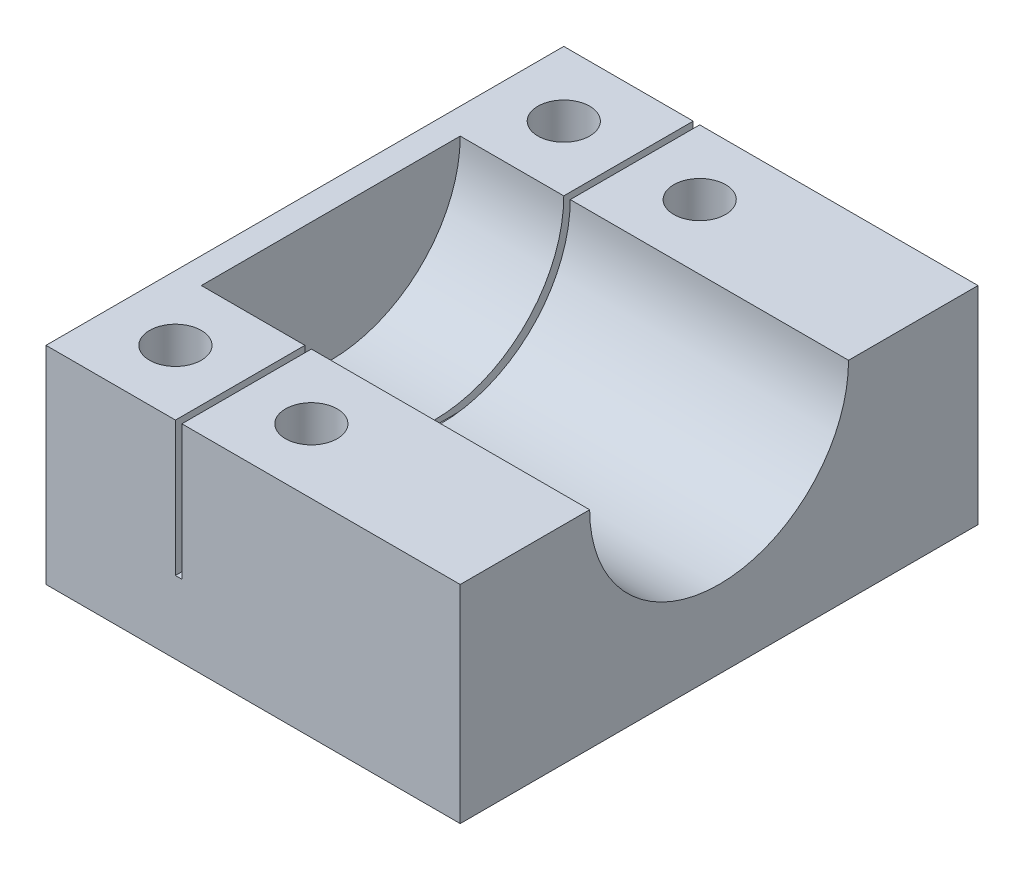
ISO-10303-21;
HEADER;
FILE_DESCRIPTION(('STEP AP214'),'2;1');
FILE_NAME('part.step','',(''),(''),'','','');
FILE_SCHEMA(('AUTOMOTIVE_DESIGN { 1 0 10303 214 1 1 1 1 }'));
ENDSEC;
DATA;
#1=APPLICATION_CONTEXT('core data for automotive mechanical design processes');
#2=APPLICATION_PROTOCOL_DEFINITION('international standard','automotive_design',2000,#1);
#3=PRODUCT_CONTEXT('',#1,'mechanical');
#4=PRODUCT('Part','Part','',(#3));
#5=PRODUCT_RELATED_PRODUCT_CATEGORY('part','',(#4));
#6=PRODUCT_DEFINITION_FORMATION('','',#4);
#7=PRODUCT_DEFINITION_CONTEXT('part definition',#1,'design');
#8=PRODUCT_DEFINITION('design','',#6,#7);
#9=PRODUCT_DEFINITION_SHAPE('','',#8);
#10=(LENGTH_UNIT() NAMED_UNIT(*) SI_UNIT(.MILLI.,.METRE.));
#11=(NAMED_UNIT(*) PLANE_ANGLE_UNIT() SI_UNIT($,.RADIAN.));
#12=(NAMED_UNIT(*) SI_UNIT($,.STERADIAN.) SOLID_ANGLE_UNIT());
#13=UNCERTAINTY_MEASURE_WITH_UNIT(LENGTH_MEASURE(1.E-05),#10,'distance_accuracy_value','');
#14=(GEOMETRIC_REPRESENTATION_CONTEXT(3) GLOBAL_UNCERTAINTY_ASSIGNED_CONTEXT((#13)) GLOBAL_UNIT_ASSIGNED_CONTEXT((#10,
#11,#12)) REPRESENTATION_CONTEXT('',''));
#15=CARTESIAN_POINT('',(0.,0.,0.));
#16=DIRECTION('',(0.,0.,1.));
#17=DIRECTION('',(1.,0.,0.));
#18=AXIS2_PLACEMENT_3D('',#15,#16,#17);
#19=CARTESIAN_POINT('',(0.,50.8,0.));
#20=DIRECTION('',(0.,-1.,0.));
#21=DIRECTION('',(0.,0.,-1.));
#22=AXIS2_PLACEMENT_3D('',#19,#20,#21);
#23=PLANE('',#22);
#24=CARTESIAN_POINT('',(49.2125,50.8,-15.875));
#25=DIRECTION('',(0.,-1.,0.));
#26=DIRECTION('',(0.,0.,-1.));
#27=AXIS2_PLACEMENT_3D('',#24,#25,#26);
#28=CIRCLE('',#27,6.35);
#29=CARTESIAN_POINT('',(49.2125,50.8,-22.225));
#30=VERTEX_POINT('',#29);
#31=EDGE_CURVE('E678',#30,#30,#28,.T.);
#32=ORIENTED_EDGE('',*,*,#31,.T.);
#33=EDGE_LOOP('',(#32));
#34=FACE_BOUND('',#33,.T.);
#35=DIRECTION('',(0.,0.,1.));
#36=VECTOR('',#35,1.);
#37=CARTESIAN_POINT('',(33.3375,50.8,0.));
#38=LINE('',#37,#36);
#39=CARTESIAN_POINT('',(33.3375,50.8,-31.75));
#40=VERTEX_POINT('',#39);
#41=CARTESIAN_POINT('',(33.3375,50.8,0.));
#42=VERTEX_POINT('',#41);
#43=EDGE_CURVE('E464',#40,#42,#38,.T.);
#44=ORIENTED_EDGE('',*,*,#43,.T.);
#45=DIRECTION('',(1.,0.,0.));
#46=VECTOR('',#45,1.);
#47=CARTESIAN_POINT('',(0.,50.8,0.));
#48=LINE('',#47,#46);
#49=CARTESIAN_POINT('',(101.6,50.8,0.));
#50=VERTEX_POINT('',#49);
#51=EDGE_CURVE('E511',#42,#50,#48,.T.);
#52=ORIENTED_EDGE('',*,*,#51,.T.);
#53=DIRECTION('',(0.,0.,-1.));
#54=VECTOR('',#53,1.);
#55=CARTESIAN_POINT('',(101.6,50.8,0.));
#56=LINE('',#55,#54);
#57=CARTESIAN_POINT('',(101.6,50.8,-31.75));
#58=VERTEX_POINT('',#57);
#59=EDGE_CURVE('E517',#50,#58,#56,.T.);
#60=ORIENTED_EDGE('',*,*,#59,.T.);
#61=DIRECTION('',(-1.,0.,0.));
#62=VECTOR('',#61,1.);
#63=CARTESIAN_POINT('',(101.600012,50.8,-31.75));
#64=LINE('',#63,#62);
#65=EDGE_CURVE('E549',#40,#58,#64,.F.);
#66=ORIENTED_EDGE('',*,*,#65,.F.);
#67=EDGE_LOOP('',(#44,#52,#60,#66));
#68=FACE_BOUND('',#67,.T.);
#69=ADVANCED_FACE('F38',(#34,#68),#23,.F.);
#70=CARTESIAN_POINT('',(49.2125,50.8,-111.125));
#71=DIRECTION('',(0.,-1.,0.));
#72=DIRECTION('',(0.,0.,-1.));
#73=AXIS2_PLACEMENT_3D('',#70,#71,#72);
#74=CIRCLE('',#73,6.35);
#75=CARTESIAN_POINT('',(49.2125,50.8,-117.475));
#76=VERTEX_POINT('',#75);
#77=EDGE_CURVE('E677',#76,#76,#74,.T.);
#78=ORIENTED_EDGE('',*,*,#77,.T.);
#79=EDGE_LOOP('',(#78));
#80=FACE_BOUND('',#79,.T.);
#81=CARTESIAN_POINT('',(33.3375,50.8,-127.));
#82=VERTEX_POINT('',#81);
#83=CARTESIAN_POINT('',(33.3375,50.8,-95.25));
#84=VERTEX_POINT('',#83);
#85=EDGE_CURVE('E488',#82,#84,#38,.T.);
#86=ORIENTED_EDGE('',*,*,#85,.T.);
#87=DIRECTION('',(-1.,0.,0.));
#88=VECTOR('',#87,1.);
#89=CARTESIAN_POINT('',(101.600012,50.8,-95.25));
#90=LINE('',#89,#88);
#91=CARTESIAN_POINT('',(101.6,50.8,-95.25));
#92=VERTEX_POINT('',#91);
#93=EDGE_CURVE('E546',#92,#84,#90,.T.);
#94=ORIENTED_EDGE('',*,*,#93,.F.);
#95=CARTESIAN_POINT('',(101.6,50.8,-127.));
#96=VERTEX_POINT('',#95);
#97=EDGE_CURVE('E516',#92,#96,#56,.T.);
#98=ORIENTED_EDGE('',*,*,#97,.T.);
#99=DIRECTION('',(-1.,0.,0.));
#100=VECTOR('',#99,1.);
#101=CARTESIAN_POINT('',(0.,50.8,-127.));
#102=LINE('',#101,#100);
#103=EDGE_CURVE('E521',#96,#82,#102,.T.);
#104=ORIENTED_EDGE('',*,*,#103,.T.);
#105=EDGE_LOOP('',(#86,#94,#98,#104));
#106=FACE_BOUND('',#105,.T.);
#107=ADVANCED_FACE('F653',(#80,#106),#23,.F.);
#108=CARTESIAN_POINT('',(0.,50.8,0.));
#109=DIRECTION('',(0.,0.,-1.));
#110=DIRECTION('',(-1.,0.,0.));
#111=AXIS2_PLACEMENT_3D('',#108,#109,#110);
#112=PLANE('',#111);
#113=DIRECTION('',(0.,1.,0.));
#114=VECTOR('',#113,1.);
#115=CARTESIAN_POINT('',(33.3375,17.78,0.));
#116=LINE('',#115,#114);
#117=CARTESIAN_POINT('',(33.3375,17.78,0.));
#118=VERTEX_POINT('',#117);
#119=EDGE_CURVE('E493',#118,#42,#116,.T.);
#120=ORIENTED_EDGE('',*,*,#119,.F.);
#121=DIRECTION('',(1.,0.,0.));
#122=VECTOR('',#121,1.);
#123=CARTESIAN_POINT('',(0.,17.78,0.));
#124=LINE('',#123,#122);
#125=CARTESIAN_POINT('',(31.75,17.78,0.));
#126=VERTEX_POINT('',#125);
#127=EDGE_CURVE('E484',#126,#118,#124,.T.);
#128=ORIENTED_EDGE('',*,*,#127,.F.);
#129=DIRECTION('',(0.,1.,0.));
#130=VECTOR('',#129,1.);
#131=CARTESIAN_POINT('',(31.75,17.78,0.));
#132=LINE('',#131,#130);
#133=CARTESIAN_POINT('',(31.75,50.8,0.));
#134=VERTEX_POINT('',#133);
#135=EDGE_CURVE('E496',#126,#134,#132,.T.);
#136=ORIENTED_EDGE('',*,*,#135,.T.);
#137=CARTESIAN_POINT('',(0.,50.8,0.));
#138=VERTEX_POINT('',#137);
#139=EDGE_CURVE('E513',#138,#134,#48,.T.);
#140=ORIENTED_EDGE('',*,*,#139,.F.);
#141=DIRECTION('',(0.,-1.,0.));
#142=VECTOR('',#141,1.);
#143=CARTESIAN_POINT('',(0.,50.8,0.));
#144=LINE('',#143,#142);
#145=CARTESIAN_POINT('',(0.,0.,0.));
#146=VERTEX_POINT('',#145);
#147=EDGE_CURVE('E540',#138,#146,#144,.T.);
#148=ORIENTED_EDGE('',*,*,#147,.T.);
#149=DIRECTION('',(1.,0.,0.));
#150=VECTOR('',#149,1.);
#151=CARTESIAN_POINT('',(0.,0.,0.));
#152=LINE('',#151,#150);
#153=CARTESIAN_POINT('',(101.6,0.,0.));
#154=VERTEX_POINT('',#153);
#155=EDGE_CURVE('E527',#146,#154,#152,.T.);
#156=ORIENTED_EDGE('',*,*,#155,.T.);
#157=DIRECTION('',(0.,-1.,0.));
#158=VECTOR('',#157,1.);
#159=CARTESIAN_POINT('',(101.6,50.8,0.));
#160=LINE('',#159,#158);
#161=EDGE_CURVE('E537',#50,#154,#160,.T.);
#162=ORIENTED_EDGE('',*,*,#161,.F.);
#163=ORIENTED_EDGE('',*,*,#51,.F.);
#164=EDGE_LOOP('',(#120,#128,#136,#140,#148,#156,#162,#163));
#165=FACE_BOUND('',#164,.T.);
#166=ADVANCED_FACE('F626',(#165),#112,.F.);
#167=CARTESIAN_POINT('',(0.,50.8,-127.));
#168=DIRECTION('',(0.,0.,1.));
#169=DIRECTION('',(1.,0.,0.));
#170=AXIS2_PLACEMENT_3D('',#167,#168,#169);
#171=PLANE('',#170);
#172=DIRECTION('',(0.,1.,0.));
#173=VECTOR('',#172,1.);
#174=CARTESIAN_POINT('',(33.3375,17.78,-127.));
#175=LINE('',#174,#173);
#176=CARTESIAN_POINT('',(33.3375,17.78,-127.));
#177=VERTEX_POINT('',#176);
#178=EDGE_CURVE('E487',#177,#82,#175,.T.);
#179=ORIENTED_EDGE('',*,*,#178,.T.);
#180=ORIENTED_EDGE('',*,*,#103,.F.);
#181=DIRECTION('',(0.,-1.,0.));
#182=VECTOR('',#181,1.);
#183=CARTESIAN_POINT('',(101.6,50.8,-127.));
#184=LINE('',#183,#182);
#185=CARTESIAN_POINT('',(101.6,0.,-127.));
#186=VERTEX_POINT('',#185);
#187=EDGE_CURVE('E534',#96,#186,#184,.T.);
#188=ORIENTED_EDGE('',*,*,#187,.T.);
#189=DIRECTION('',(-1.,0.,0.));
#190=VECTOR('',#189,1.);
#191=CARTESIAN_POINT('',(0.,0.,-127.));
#192=LINE('',#191,#190);
#193=CARTESIAN_POINT('',(0.,0.,-127.));
#194=VERTEX_POINT('',#193);
#195=EDGE_CURVE('E512',#186,#194,#192,.T.);
#196=ORIENTED_EDGE('',*,*,#195,.T.);
#197=DIRECTION('',(0.,-1.,0.));
#198=VECTOR('',#197,1.);
#199=CARTESIAN_POINT('',(0.,50.8,-127.));
#200=LINE('',#199,#198);
#201=CARTESIAN_POINT('',(0.,50.8,-127.));
#202=VERTEX_POINT('',#201);
#203=EDGE_CURVE('E524',#202,#194,#200,.T.);
#204=ORIENTED_EDGE('',*,*,#203,.F.);
#205=CARTESIAN_POINT('',(31.75,50.8,-127.));
#206=VERTEX_POINT('',#205);
#207=EDGE_CURVE('E520',#206,#202,#102,.T.);
#208=ORIENTED_EDGE('',*,*,#207,.F.);
#209=DIRECTION('',(0.,1.,0.));
#210=VECTOR('',#209,1.);
#211=CARTESIAN_POINT('',(31.75,17.78,-127.));
#212=LINE('',#211,#210);
#213=CARTESIAN_POINT('',(31.75,17.78,-127.));
#214=VERTEX_POINT('',#213);
#215=EDGE_CURVE('E499',#214,#206,#212,.T.);
#216=ORIENTED_EDGE('',*,*,#215,.F.);
#217=DIRECTION('',(-1.,0.,0.));
#218=VECTOR('',#217,1.);
#219=CARTESIAN_POINT('',(0.,17.78,-127.));
#220=LINE('',#219,#218);
#221=EDGE_CURVE('E477',#177,#214,#220,.T.);
#222=ORIENTED_EDGE('',*,*,#221,.F.);
#223=EDGE_LOOP('',(#179,#180,#188,#196,#204,#208,#216,#222));
#224=FACE_BOUND('',#223,.T.);
#225=ADVANCED_FACE('F614',(#224),#171,.F.);
#226=CARTESIAN_POINT('',(101.600012,50.8,-63.5));
#227=DIRECTION('',(-1.,0.,0.));
#228=DIRECTION('',(0.,0.,1.));
#229=AXIS2_PLACEMENT_3D('',#226,#227,#228);
#230=CYLINDRICAL_SURFACE('',#229,31.75);
#231=ORIENTED_EDGE('',*,*,#93,.T.);
#232=CARTESIAN_POINT('',(33.3375,50.8,-63.5));
#233=DIRECTION('',(-1.,0.,0.));
#234=DIRECTION('',(0.,0.,1.));
#235=AXIS2_PLACEMENT_3D('',#232,#233,#234);
#236=CIRCLE('',#235,31.75);
#237=EDGE_CURVE('E11',#84,#40,#236,.T.);
#238=ORIENTED_EDGE('',*,*,#237,.T.);
#239=ORIENTED_EDGE('',*,*,#65,.T.);
#240=CARTESIAN_POINT('',(101.6,50.8,-63.5));
#241=DIRECTION('',(-1.,0.,0.));
#242=DIRECTION('',(0.,0.,1.));
#243=AXIS2_PLACEMENT_3D('',#240,#241,#242);
#244=CIRCLE('',#243,31.75);
#245=EDGE_CURVE('E505',#58,#92,#244,.F.);
#246=ORIENTED_EDGE('',*,*,#245,.T.);
#247=EDGE_LOOP('',(#231,#238,#239,#246));
#248=FACE_BOUND('',#247,.T.);
#249=ADVANCED_FACE('F650',(#248),#230,.F.);
#250=CARTESIAN_POINT('',(15.875,50.8,-15.875));
#251=DIRECTION('',(0.,-1.,0.));
#252=DIRECTION('',(0.,0.,-1.));
#253=AXIS2_PLACEMENT_3D('',#250,#251,#252);
#254=CIRCLE('',#253,6.35);
#255=CARTESIAN_POINT('',(15.875,50.8,-22.225));
#256=VERTEX_POINT('',#255);
#257=EDGE_CURVE('E673',#256,#256,#254,.T.);
#258=ORIENTED_EDGE('',*,*,#257,.T.);
#259=EDGE_LOOP('',(#258));
#260=FACE_BOUND('',#259,.T.);
#261=CARTESIAN_POINT('',(15.875,50.8,-111.125));
#262=DIRECTION('',(0.,-1.,0.));
#263=DIRECTION('',(0.,0.,-1.));
#264=AXIS2_PLACEMENT_3D('',#261,#262,#263);
#265=CIRCLE('',#264,6.35);
#266=CARTESIAN_POINT('',(15.875,50.8,-117.475));
#267=VERTEX_POINT('',#266);
#268=EDGE_CURVE('E304',#267,#267,#265,.T.);
#269=ORIENTED_EDGE('',*,*,#268,.T.);
#270=EDGE_LOOP('',(#269));
#271=FACE_BOUND('',#270,.T.);
#272=ORIENTED_EDGE('',*,*,#139,.T.);
#273=DIRECTION('',(0.,0.,1.));
#274=VECTOR('',#273,1.);
#275=CARTESIAN_POINT('',(31.75,50.8,0.));
#276=LINE('',#275,#274);
#277=CARTESIAN_POINT('',(31.75,50.8,-31.75));
#278=VERTEX_POINT('',#277);
#279=EDGE_CURVE('E491',#278,#134,#276,.T.);
#280=ORIENTED_EDGE('',*,*,#279,.F.);
#281=CARTESIAN_POINT('',(6.34999999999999,50.8,-31.75));
#282=VERTEX_POINT('',#281);
#283=EDGE_CURVE('E550',#282,#278,#64,.F.);
#284=ORIENTED_EDGE('',*,*,#283,.F.);
#285=DIRECTION('',(0.,0.,1.));
#286=VECTOR('',#285,1.);
#287=CARTESIAN_POINT('',(6.34999999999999,50.8,0.));
#288=LINE('',#287,#286);
#289=CARTESIAN_POINT('',(6.34999999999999,50.8,-95.25));
#290=VERTEX_POINT('',#289);
#291=EDGE_CURVE('E543',#290,#282,#288,.T.);
#292=ORIENTED_EDGE('',*,*,#291,.F.);
#293=CARTESIAN_POINT('',(31.75,50.8,-95.25));
#294=VERTEX_POINT('',#293);
#295=EDGE_CURVE('E545',#294,#290,#90,.T.);
#296=ORIENTED_EDGE('',*,*,#295,.F.);
#297=EDGE_CURVE('E478',#206,#294,#276,.T.);
#298=ORIENTED_EDGE('',*,*,#297,.F.);
#299=ORIENTED_EDGE('',*,*,#207,.T.);
#300=DIRECTION('',(0.,0.,1.));
#301=VECTOR('',#300,1.);
#302=CARTESIAN_POINT('',(0.,50.8,0.));
#303=LINE('',#302,#301);
#304=EDGE_CURVE('E508',#202,#138,#303,.T.);
#305=ORIENTED_EDGE('',*,*,#304,.T.);
#306=EDGE_LOOP('',(#272,#280,#284,#292,#296,#298,#299,#305));
#307=FACE_BOUND('',#306,.T.);
#308=ADVANCED_FACE('F630',(#260,#271,#307),#23,.F.);
#309=CARTESIAN_POINT('',(0.,50.8,0.));
#310=DIRECTION('',(1.,0.,0.));
#311=DIRECTION('',(0.,0.,-1.));
#312=AXIS2_PLACEMENT_3D('',#309,#310,#311);
#313=PLANE('',#312);
#314=DIRECTION('',(0.,0.,1.));
#315=VECTOR('',#314,1.);
#316=CARTESIAN_POINT('',(0.,0.,0.));
#317=LINE('',#316,#315);
#318=EDGE_CURVE('E507',#194,#146,#317,.T.);
#319=ORIENTED_EDGE('',*,*,#318,.T.);
#320=ORIENTED_EDGE('',*,*,#147,.F.);
#321=ORIENTED_EDGE('',*,*,#304,.F.);
#322=ORIENTED_EDGE('',*,*,#203,.T.);
#323=EDGE_LOOP('',(#319,#320,#321,#322));
#324=FACE_BOUND('',#323,.T.);
#325=ADVANCED_FACE('F40',(#324),#313,.F.);
#326=CARTESIAN_POINT('',(101.6,50.8,0.));
#327=DIRECTION('',(-1.,0.,0.));
#328=DIRECTION('',(0.,0.,1.));
#329=AXIS2_PLACEMENT_3D('',#326,#327,#328);
#330=PLANE('',#329);
#331=ORIENTED_EDGE('',*,*,#245,.F.);
#332=ORIENTED_EDGE('',*,*,#59,.F.);
#333=ORIENTED_EDGE('',*,*,#161,.T.);
#334=DIRECTION('',(0.,0.,-1.));
#335=VECTOR('',#334,1.);
#336=CARTESIAN_POINT('',(101.6,0.,0.));
#337=LINE('',#336,#335);
#338=EDGE_CURVE('E529',#154,#186,#337,.T.);
#339=ORIENTED_EDGE('',*,*,#338,.T.);
#340=ORIENTED_EDGE('',*,*,#187,.F.);
#341=ORIENTED_EDGE('',*,*,#97,.F.);
#342=EDGE_LOOP('',(#331,#332,#333,#339,#340,#341));
#343=FACE_BOUND('',#342,.T.);
#344=ADVANCED_FACE('F602',(#343),#330,.F.);
#345=CARTESIAN_POINT('',(0.,0.,0.));
#346=DIRECTION('',(0.,-1.,0.));
#347=DIRECTION('',(0.,0.,-1.));
#348=AXIS2_PLACEMENT_3D('',#345,#346,#347);
#349=PLANE('',#348);
#350=DIRECTION('',(-0.866025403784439,0.,0.5));
#351=VECTOR('',#350,1.);
#352=CARTESIAN_POINT('',(-39.3872864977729,0.,-68.2207813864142));
#353=LINE('',#352,#351);
#354=CARTESIAN_POINT('',(25.4,0.,-105.625738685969));
#355=VERTEX_POINT('',#354);
#356=CARTESIAN_POINT('',(15.875,0.,-100.126477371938));
#357=VERTEX_POINT('',#356);
#358=EDGE_CURVE('E55',#355,#357,#353,.T.);
#359=ORIENTED_EDGE('',*,*,#358,.F.);
#360=DIRECTION('',(0.,0.,1.));
#361=VECTOR('',#360,1.);
#362=CARTESIAN_POINT('',(25.4,0.,0.));
#363=LINE('',#362,#361);
#364=CARTESIAN_POINT('',(25.4,0.,-116.624261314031));
#365=VERTEX_POINT('',#364);
#366=EDGE_CURVE('E386',#365,#355,#363,.T.);
#367=ORIENTED_EDGE('',*,*,#366,.F.);
#368=DIRECTION('',(0.866025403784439,0.,0.499999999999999));
#369=VECTOR('',#368,1.);
#370=CARTESIAN_POINT('',(56.8497864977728,0.,-98.4667186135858));
#371=LINE('',#370,#369);
#372=CARTESIAN_POINT('',(15.875,0.,-122.123522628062));
#373=VERTEX_POINT('',#372);
#374=EDGE_CURVE('E412',#373,#365,#371,.T.);
#375=ORIENTED_EDGE('',*,*,#374,.F.);
#376=DIRECTION('',(0.866025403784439,0.,-0.499999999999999));
#377=VECTOR('',#376,1.);
#378=CARTESIAN_POINT('',(-48.9122864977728,0.,-84.7185653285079));
#379=LINE('',#378,#377);
#380=CARTESIAN_POINT('',(6.35,0.,-116.624261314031));
#381=VERTEX_POINT('',#380);
#382=EDGE_CURVE('E409',#381,#373,#379,.T.);
#383=ORIENTED_EDGE('',*,*,#382,.F.);
#384=DIRECTION('',(0.,0.,-1.));
#385=VECTOR('',#384,1.);
#386=CARTESIAN_POINT('',(6.35,0.,0.));
#387=LINE('',#386,#385);
#388=CARTESIAN_POINT('',(6.35,0.,-105.625738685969));
#389=VERTEX_POINT('',#388);
#390=EDGE_CURVE('E406',#389,#381,#387,.T.);
#391=ORIENTED_EDGE('',*,*,#390,.F.);
#392=DIRECTION('',(-0.866025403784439,0.,-0.5));
#393=VECTOR('',#392,1.);
#394=CARTESIAN_POINT('',(47.3247864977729,0.,-81.9689346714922));
#395=LINE('',#394,#393);
#396=EDGE_CURVE('E403',#357,#389,#395,.T.);
#397=ORIENTED_EDGE('',*,*,#396,.F.);
#398=EDGE_LOOP('',(#359,#367,#375,#383,#391,#397));
#399=FACE_BOUND('',#398,.T.);
#400=DIRECTION('',(-0.866025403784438,0.,0.5));
#401=VECTOR('',#400,1.);
#402=CARTESIAN_POINT('',(-31.0529114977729,0.,-53.7852204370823));
#403=LINE('',#402,#401);
#404=CARTESIAN_POINT('',(58.7375,0.,-105.625738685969));
#405=VERTEX_POINT('',#404);
#406=CARTESIAN_POINT('',(49.2125,0.,-100.126477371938));
#407=VERTEX_POINT('',#406);
#408=EDGE_CURVE('E63',#405,#407,#403,.T.);
#409=ORIENTED_EDGE('',*,*,#408,.F.);
#410=DIRECTION('',(0.,0.,1.));
#411=VECTOR('',#410,1.);
#412=CARTESIAN_POINT('',(58.7375,0.,0.));
#413=LINE('',#412,#411);
#414=CARTESIAN_POINT('',(58.7375,0.,-116.624261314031));
#415=VERTEX_POINT('',#414);
#416=EDGE_CURVE('E340',#415,#405,#413,.T.);
#417=ORIENTED_EDGE('',*,*,#416,.F.);
#418=DIRECTION('',(0.866025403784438,0.,0.5));
#419=VECTOR('',#418,1.);
#420=CARTESIAN_POINT('',(65.1841614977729,0.,-112.902279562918));
#421=LINE('',#420,#419);
#422=CARTESIAN_POINT('',(49.2125,0.,-122.123522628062));
#423=VERTEX_POINT('',#422);
#424=EDGE_CURVE('E367',#423,#415,#421,.T.);
#425=ORIENTED_EDGE('',*,*,#424,.F.);
#426=DIRECTION('',(0.866025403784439,0.,-0.5));
#427=VECTOR('',#426,1.);
#428=CARTESIAN_POINT('',(-40.5779114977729,0.,-70.283004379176));
#429=LINE('',#428,#427);
#430=CARTESIAN_POINT('',(39.6875,0.,-116.624261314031));
#431=VERTEX_POINT('',#430);
#432=EDGE_CURVE('E364',#431,#423,#429,.T.);
#433=ORIENTED_EDGE('',*,*,#432,.F.);
#434=DIRECTION('',(0.,0.,-1.));
#435=VECTOR('',#434,1.);
#436=CARTESIAN_POINT('',(39.6874999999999,0.,0.));
#437=LINE('',#436,#435);
#438=CARTESIAN_POINT('',(39.6875,0.,-105.625738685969));
#439=VERTEX_POINT('',#438);
#440=EDGE_CURVE('E361',#439,#431,#437,.T.);
#441=ORIENTED_EDGE('',*,*,#440,.F.);
#442=DIRECTION('',(-0.866025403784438,0.,-0.500000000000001));
#443=VECTOR('',#442,1.);
#444=CARTESIAN_POINT('',(55.659161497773,0.,-96.404495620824));
#445=LINE('',#444,#443);
#446=EDGE_CURVE('E357',#407,#439,#445,.T.);
#447=ORIENTED_EDGE('',*,*,#446,.F.);
#448=EDGE_LOOP('',(#409,#417,#425,#433,#441,#447));
#449=FACE_BOUND('',#448,.T.);
#450=DIRECTION('',(0.,0.,1.));
#451=VECTOR('',#450,1.);
#452=CARTESIAN_POINT('',(58.7375,0.,0.));
#453=LINE('',#452,#451);
#454=CARTESIAN_POINT('',(58.7375,0.,-21.3742613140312));
#455=VERTEX_POINT('',#454);
#456=CARTESIAN_POINT('',(58.7375,0.,-10.3757386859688));
#457=VERTEX_POINT('',#456);
#458=EDGE_CURVE('E280',#455,#457,#453,.T.);
#459=ORIENTED_EDGE('',*,*,#458,.F.);
#460=DIRECTION('',(0.866025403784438,0.,0.5));
#461=VECTOR('',#460,1.);
#462=CARTESIAN_POINT('',(23.939701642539,0.,-41.4647795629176));
#463=LINE('',#462,#461);
#464=CARTESIAN_POINT('',(49.2125,0.,-26.8735226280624));
#465=VERTEX_POINT('',#464);
#466=EDGE_CURVE('E298',#465,#455,#463,.T.);
#467=ORIENTED_EDGE('',*,*,#466,.F.);
#468=DIRECTION('',(0.866025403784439,0.,-0.5));
#469=VECTOR('',#468,1.);
#470=CARTESIAN_POINT('',(0.666548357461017,0.,1.15449562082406));
#471=LINE('',#470,#469);
#472=CARTESIAN_POINT('',(39.6875,0.,-21.3742613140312));
#473=VERTEX_POINT('',#472);
#474=EDGE_CURVE('E301',#473,#465,#471,.T.);
#475=ORIENTED_EDGE('',*,*,#474,.F.);
#476=DIRECTION('',(0.,0.,-1.));
#477=VECTOR('',#476,1.);
#478=CARTESIAN_POINT('',(39.6875,0.,0.));
#479=LINE('',#478,#477);
#480=CARTESIAN_POINT('',(39.6875,0.,-10.3757386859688));
#481=VERTEX_POINT('',#480);
#482=EDGE_CURVE('E321',#481,#473,#479,.T.);
#483=ORIENTED_EDGE('',*,*,#482,.F.);
#484=DIRECTION('',(-0.866025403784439,0.,-0.499999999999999));
#485=VECTOR('',#484,1.);
#486=CARTESIAN_POINT('',(14.4147016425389,0.,-24.966995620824));
#487=LINE('',#486,#485);
#488=CARTESIAN_POINT('',(49.2125,0.,-4.87647737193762));
#489=VERTEX_POINT('',#488);
#490=EDGE_CURVE('E318',#489,#481,#487,.T.);
#491=ORIENTED_EDGE('',*,*,#490,.F.);
#492=DIRECTION('',(-0.866025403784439,0.,0.5));
#493=VECTOR('',#492,1.);
#494=CARTESIAN_POINT('',(10.191548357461,0.,17.6522795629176));
#495=LINE('',#494,#493);
#496=EDGE_CURVE('E315',#457,#489,#495,.T.);
#497=ORIENTED_EDGE('',*,*,#496,.F.);
#498=EDGE_LOOP('',(#459,#467,#475,#483,#491,#497));
#499=FACE_BOUND('',#498,.T.);
#500=DIRECTION('',(-0.866025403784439,0.,0.5));
#501=VECTOR('',#500,1.);
#502=CARTESIAN_POINT('',(1.85717335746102,0.,3.21671861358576));
#503=LINE('',#502,#501);
#504=CARTESIAN_POINT('',(25.4,0.,-10.3757386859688));
#505=VERTEX_POINT('',#504);
#506=CARTESIAN_POINT('',(15.875,0.,-4.87647737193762));
#507=VERTEX_POINT('',#506);
#508=EDGE_CURVE('E328',#505,#507,#503,.T.);
#509=ORIENTED_EDGE('',*,*,#508,.F.);
#510=DIRECTION('',(0.,0.,1.));
#511=VECTOR('',#510,1.);
#512=CARTESIAN_POINT('',(25.4,0.,0.));
#513=LINE('',#512,#511);
#514=CARTESIAN_POINT('',(25.4,0.,-21.3742613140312));
#515=VERTEX_POINT('',#514);
#516=EDGE_CURVE('E431',#515,#505,#513,.T.);
#517=ORIENTED_EDGE('',*,*,#516,.F.);
#518=DIRECTION('',(0.866025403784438,0.,0.500000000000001));
#519=VECTOR('',#518,1.);
#520=CARTESIAN_POINT('',(15.605326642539,0.,-27.0292186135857));
#521=LINE('',#520,#519);
#522=CARTESIAN_POINT('',(15.875,0.,-26.8735226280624));
#523=VERTEX_POINT('',#522);
#524=EDGE_CURVE('E457',#523,#515,#521,.T.);
#525=ORIENTED_EDGE('',*,*,#524,.F.);
#526=DIRECTION('',(0.866025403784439,0.,-0.5));
#527=VECTOR('',#526,1.);
#528=CARTESIAN_POINT('',(-7.66782664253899,0.,-13.2810653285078));
#529=LINE('',#528,#527);
#530=CARTESIAN_POINT('',(6.34999999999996,0.,-21.3742613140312));
#531=VERTEX_POINT('',#530);
#532=EDGE_CURVE('E454',#531,#523,#529,.T.);
#533=ORIENTED_EDGE('',*,*,#532,.F.);
#534=DIRECTION('',(0.,0.,-1.));
#535=VECTOR('',#534,1.);
#536=CARTESIAN_POINT('',(6.34999999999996,0.,0.));
#537=LINE('',#536,#535);
#538=CARTESIAN_POINT('',(6.34999999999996,0.,-10.3757386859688));
#539=VERTEX_POINT('',#538);
#540=EDGE_CURVE('E451',#539,#531,#537,.T.);
#541=ORIENTED_EDGE('',*,*,#540,.F.);
#542=DIRECTION('',(-0.866025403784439,0.,-0.5));
#543=VECTOR('',#542,1.);
#544=CARTESIAN_POINT('',(6.08032664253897,0.,-10.5314346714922));
#545=LINE('',#544,#543);
#546=EDGE_CURVE('E448',#507,#539,#545,.T.);
#547=ORIENTED_EDGE('',*,*,#546,.F.);
#548=EDGE_LOOP('',(#509,#517,#525,#533,#541,#547));
#549=FACE_BOUND('',#548,.T.);
#550=ORIENTED_EDGE('',*,*,#318,.F.);
#551=ORIENTED_EDGE('',*,*,#195,.F.);
#552=ORIENTED_EDGE('',*,*,#338,.F.);
#553=ORIENTED_EDGE('',*,*,#155,.F.);
#554=EDGE_LOOP('',(#550,#551,#552,#553));
#555=FACE_BOUND('',#554,.T.);
#556=ADVANCED_FACE('F598',(#399,#449,#499,#549,#555),#349,.T.);
#557=CARTESIAN_POINT('',(31.75,50.8,-63.5));
#558=DIRECTION('',(-1.,0.,0.));
#559=DIRECTION('',(0.,0.,1.));
#560=AXIS2_PLACEMENT_3D('',#557,#558,#559);
#561=CIRCLE('',#560,31.75);
#562=EDGE_CURVE('E47',#294,#278,#561,.T.);
#563=ORIENTED_EDGE('',*,*,#562,.F.);
#564=ORIENTED_EDGE('',*,*,#295,.T.);
#565=CARTESIAN_POINT('',(6.34999999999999,50.8,-63.5));
#566=DIRECTION('',(1.,0.,0.));
#567=DIRECTION('',(0.,0.,-1.));
#568=AXIS2_PLACEMENT_3D('',#565,#566,#567);
#569=CIRCLE('',#568,31.75);
#570=EDGE_CURVE('E495',#282,#290,#569,.T.);
#571=ORIENTED_EDGE('',*,*,#570,.F.);
#572=ORIENTED_EDGE('',*,*,#283,.T.);
#573=EDGE_LOOP('',(#563,#564,#571,#572));
#574=FACE_BOUND('',#573,.T.);
#575=ADVANCED_FACE('F601',(#574),#230,.F.);
#576=CARTESIAN_POINT('',(6.34999999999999,50.8,-63.5));
#577=DIRECTION('',(1.,0.,0.));
#578=DIRECTION('',(0.,0.,-1.));
#579=AXIS2_PLACEMENT_3D('',#576,#577,#578);
#580=PLANE('',#579);
#581=ORIENTED_EDGE('',*,*,#291,.T.);
#582=ORIENTED_EDGE('',*,*,#570,.T.);
#583=EDGE_LOOP('',(#581,#582));
#584=FACE_BOUND('',#583,.T.);
#585=ADVANCED_FACE('F796',(#584),#580,.T.);
#586=CARTESIAN_POINT('',(33.3375,17.78,0.));
#587=DIRECTION('',(-1.,0.,0.));
#588=DIRECTION('',(0.,0.,1.));
#589=AXIS2_PLACEMENT_3D('',#586,#587,#588);
#590=PLANE('',#589);
#591=ORIENTED_EDGE('',*,*,#85,.F.);
#592=ORIENTED_EDGE('',*,*,#178,.F.);
#593=DIRECTION('',(0.,0.,1.));
#594=VECTOR('',#593,1.);
#595=CARTESIAN_POINT('',(33.3375,17.78,0.));
#596=LINE('',#595,#594);
#597=EDGE_CURVE('E475',#177,#118,#596,.T.);
#598=ORIENTED_EDGE('',*,*,#597,.T.);
#599=ORIENTED_EDGE('',*,*,#119,.T.);
#600=ORIENTED_EDGE('',*,*,#43,.F.);
#601=ORIENTED_EDGE('',*,*,#237,.F.);
#602=EDGE_LOOP('',(#591,#592,#598,#599,#600,#601));
#603=FACE_BOUND('',#602,.T.);
#604=ADVANCED_FACE('F646',(#603),#590,.T.);
#605=CARTESIAN_POINT('',(31.75,17.78,0.));
#606=DIRECTION('',(-1.,0.,0.));
#607=DIRECTION('',(0.,0.,1.));
#608=AXIS2_PLACEMENT_3D('',#605,#606,#607);
#609=PLANE('',#608);
#610=ORIENTED_EDGE('',*,*,#562,.T.);
#611=ORIENTED_EDGE('',*,*,#279,.T.);
#612=ORIENTED_EDGE('',*,*,#135,.F.);
#613=DIRECTION('',(0.,0.,1.));
#614=VECTOR('',#613,1.);
#615=CARTESIAN_POINT('',(31.75,17.78,0.));
#616=LINE('',#615,#614);
#617=EDGE_CURVE('E481',#214,#126,#616,.T.);
#618=ORIENTED_EDGE('',*,*,#617,.F.);
#619=ORIENTED_EDGE('',*,*,#215,.T.);
#620=ORIENTED_EDGE('',*,*,#297,.T.);
#621=EDGE_LOOP('',(#610,#611,#612,#618,#619,#620));
#622=FACE_BOUND('',#621,.T.);
#623=ADVANCED_FACE('F636',(#622),#609,.F.);
#624=CARTESIAN_POINT('',(0.,17.78,0.));
#625=DIRECTION('',(0.,1.,0.));
#626=DIRECTION('',(0.,0.,1.));
#627=AXIS2_PLACEMENT_3D('',#624,#625,#626);
#628=PLANE('',#627);
#629=ORIENTED_EDGE('',*,*,#597,.F.);
#630=ORIENTED_EDGE('',*,*,#221,.T.);
#631=ORIENTED_EDGE('',*,*,#617,.T.);
#632=ORIENTED_EDGE('',*,*,#127,.T.);
#633=EDGE_LOOP('',(#629,#630,#631,#632));
#634=FACE_BOUND('',#633,.T.);
#635=ADVANCED_FACE('F642',(#634),#628,.T.);
#636=CARTESIAN_POINT('',(1.85717335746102,6.35,3.21671861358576));
#637=DIRECTION('',(0.5,0.,0.866025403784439));
#638=DIRECTION('',(0.866025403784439,0.,-0.5));
#639=AXIS2_PLACEMENT_3D('',#636,#637,#638);
#640=PLANE('',#639);
#641=ORIENTED_EDGE('',*,*,#508,.T.);
#642=DIRECTION('',(0.,-1.,0.));
#643=VECTOR('',#642,1.);
#644=CARTESIAN_POINT('',(15.875,6.35,-4.87647737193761));
#645=LINE('',#644,#643);
#646=CARTESIAN_POINT('',(15.875,6.35,-4.87647737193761));
#647=VERTEX_POINT('',#646);
#648=EDGE_CURVE('E446',#647,#507,#645,.T.);
#649=ORIENTED_EDGE('',*,*,#648,.F.);
#650=DIRECTION('',(-0.866025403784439,0.,0.5));
#651=VECTOR('',#650,1.);
#652=CARTESIAN_POINT('',(1.85717335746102,6.35,3.21671861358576));
#653=LINE('',#652,#651);
#654=CARTESIAN_POINT('',(25.4,6.35,-10.3757386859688));
#655=VERTEX_POINT('',#654);
#656=EDGE_CURVE('E427',#655,#647,#653,.T.);
#657=ORIENTED_EDGE('',*,*,#656,.F.);
#658=DIRECTION('',(0.,-1.,0.));
#659=VECTOR('',#658,1.);
#660=CARTESIAN_POINT('',(25.4,6.35,-10.3757386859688));
#661=LINE('',#660,#659);
#662=EDGE_CURVE('E462',#655,#505,#661,.T.);
#663=ORIENTED_EDGE('',*,*,#662,.T.);
#664=EDGE_LOOP('',(#641,#649,#657,#663));
#665=FACE_BOUND('',#664,.T.);
#666=ADVANCED_FACE('F578',(#665),#640,.F.);
#667=CARTESIAN_POINT('',(25.4,6.35,0.));
#668=DIRECTION('',(1.,0.,0.));
#669=DIRECTION('',(0.,0.,-1.));
#670=AXIS2_PLACEMENT_3D('',#667,#668,#669);
#671=PLANE('',#670);
#672=ORIENTED_EDGE('',*,*,#516,.T.);
#673=ORIENTED_EDGE('',*,*,#662,.F.);
#674=DIRECTION('',(0.,0.,1.));
#675=VECTOR('',#674,1.);
#676=CARTESIAN_POINT('',(25.4,6.35,0.));
#677=LINE('',#676,#675);
#678=CARTESIAN_POINT('',(25.4,6.35,-21.3742613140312));
#679=VERTEX_POINT('',#678);
#680=EDGE_CURVE('E443',#679,#655,#677,.T.);
#681=ORIENTED_EDGE('',*,*,#680,.F.);
#682=DIRECTION('',(0.,-1.,0.));
#683=VECTOR('',#682,1.);
#684=CARTESIAN_POINT('',(25.4,6.35,-21.3742613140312));
#685=LINE('',#684,#683);
#686=EDGE_CURVE('E465',#679,#515,#685,.T.);
#687=ORIENTED_EDGE('',*,*,#686,.T.);
#688=EDGE_LOOP('',(#672,#673,#681,#687));
#689=FACE_BOUND('',#688,.T.);
#690=ADVANCED_FACE('F596',(#689),#671,.F.);
#691=CARTESIAN_POINT('',(15.605326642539,6.35,-27.0292186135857));
#692=DIRECTION('',(0.500000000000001,0.,-0.866025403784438));
#693=DIRECTION('',(-0.866025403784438,0.,-0.500000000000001));
#694=AXIS2_PLACEMENT_3D('',#691,#692,#693);
#695=PLANE('',#694);
#696=ORIENTED_EDGE('',*,*,#524,.T.);
#697=ORIENTED_EDGE('',*,*,#686,.F.);
#698=DIRECTION('',(0.866025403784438,0.,0.500000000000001));
#699=VECTOR('',#698,1.);
#700=CARTESIAN_POINT('',(15.605326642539,6.35,-27.0292186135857));
#701=LINE('',#700,#699);
#702=CARTESIAN_POINT('',(15.875,6.35,-26.8735226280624));
#703=VERTEX_POINT('',#702);
#704=EDGE_CURVE('E440',#703,#679,#701,.T.);
#705=ORIENTED_EDGE('',*,*,#704,.F.);
#706=DIRECTION('',(0.,-1.,0.));
#707=VECTOR('',#706,1.);
#708=CARTESIAN_POINT('',(15.875,6.35,-26.8735226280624));
#709=LINE('',#708,#707);
#710=EDGE_CURVE('E467',#703,#523,#709,.T.);
#711=ORIENTED_EDGE('',*,*,#710,.T.);
#712=EDGE_LOOP('',(#696,#697,#705,#711));
#713=FACE_BOUND('',#712,.T.);
#714=ADVANCED_FACE('F593',(#713),#695,.F.);
#715=CARTESIAN_POINT('',(-7.66782664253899,6.35,-13.2810653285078));
#716=DIRECTION('',(-0.5,0.,-0.866025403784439));
#717=DIRECTION('',(-0.866025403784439,0.,0.5));
#718=AXIS2_PLACEMENT_3D('',#715,#716,#717);
#719=PLANE('',#718);
#720=ORIENTED_EDGE('',*,*,#532,.T.);
#721=ORIENTED_EDGE('',*,*,#710,.F.);
#722=DIRECTION('',(0.866025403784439,0.,-0.5));
#723=VECTOR('',#722,1.);
#724=CARTESIAN_POINT('',(-7.66782664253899,6.35,-13.2810653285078));
#725=LINE('',#724,#723);
#726=CARTESIAN_POINT('',(6.34999999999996,6.35,-21.3742613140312));
#727=VERTEX_POINT('',#726);
#728=EDGE_CURVE('E437',#727,#703,#725,.T.);
#729=ORIENTED_EDGE('',*,*,#728,.F.);
#730=DIRECTION('',(0.,-1.,0.));
#731=VECTOR('',#730,1.);
#732=CARTESIAN_POINT('',(6.34999999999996,6.35,-21.3742613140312));
#733=LINE('',#732,#731);
#734=EDGE_CURVE('E469',#727,#531,#733,.T.);
#735=ORIENTED_EDGE('',*,*,#734,.T.);
#736=EDGE_LOOP('',(#720,#721,#729,#735));
#737=FACE_BOUND('',#736,.T.);
#738=ADVANCED_FACE('F589',(#737),#719,.F.);
#739=CARTESIAN_POINT('',(6.34999999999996,6.35,0.));
#740=DIRECTION('',(-1.,0.,0.));
#741=DIRECTION('',(0.,0.,1.));
#742=AXIS2_PLACEMENT_3D('',#739,#740,#741);
#743=PLANE('',#742);
#744=ORIENTED_EDGE('',*,*,#540,.T.);
#745=ORIENTED_EDGE('',*,*,#734,.F.);
#746=DIRECTION('',(0.,0.,-1.));
#747=VECTOR('',#746,1.);
#748=CARTESIAN_POINT('',(6.34999999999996,6.35,0.));
#749=LINE('',#748,#747);
#750=CARTESIAN_POINT('',(6.34999999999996,6.35,-10.3757386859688));
#751=VERTEX_POINT('',#750);
#752=EDGE_CURVE('E434',#751,#727,#749,.T.);
#753=ORIENTED_EDGE('',*,*,#752,.F.);
#754=DIRECTION('',(0.,-1.,0.));
#755=VECTOR('',#754,1.);
#756=CARTESIAN_POINT('',(6.34999999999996,6.35,-10.3757386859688));
#757=LINE('',#756,#755);
#758=EDGE_CURVE('E471',#751,#539,#757,.T.);
#759=ORIENTED_EDGE('',*,*,#758,.T.);
#760=EDGE_LOOP('',(#744,#745,#753,#759));
#761=FACE_BOUND('',#760,.T.);
#762=ADVANCED_FACE('F585',(#761),#743,.F.);
#763=CARTESIAN_POINT('',(6.08032664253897,6.35,-10.5314346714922));
#764=DIRECTION('',(-0.5,0.,0.866025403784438));
#765=DIRECTION('',(0.866025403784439,0.,0.5));
#766=AXIS2_PLACEMENT_3D('',#763,#764,#765);
#767=PLANE('',#766);
#768=ORIENTED_EDGE('',*,*,#546,.T.);
#769=ORIENTED_EDGE('',*,*,#758,.F.);
#770=DIRECTION('',(-0.866025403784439,0.,-0.5));
#771=VECTOR('',#770,1.);
#772=CARTESIAN_POINT('',(6.08032664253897,6.35,-10.5314346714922));
#773=LINE('',#772,#771);
#774=EDGE_CURVE('E430',#647,#751,#773,.T.);
#775=ORIENTED_EDGE('',*,*,#774,.F.);
#776=ORIENTED_EDGE('',*,*,#648,.T.);
#777=EDGE_LOOP('',(#768,#769,#775,#776));
#778=FACE_BOUND('',#777,.T.);
#779=ADVANCED_FACE('F572',(#778),#767,.F.);
#780=CARTESIAN_POINT('',(0.,6.35,0.));
#781=DIRECTION('',(0.,-1.,0.));
#782=DIRECTION('',(0.,0.,-1.));
#783=AXIS2_PLACEMENT_3D('',#780,#781,#782);
#784=PLANE('',#783);
#785=CARTESIAN_POINT('',(15.875,6.35,-15.875));
#786=DIRECTION('',(0.,-1.,0.));
#787=DIRECTION('',(0.,0.,-1.));
#788=AXIS2_PLACEMENT_3D('',#785,#786,#787);
#789=CIRCLE('',#788,6.35);
#790=CARTESIAN_POINT('',(15.875,6.35,-22.225));
#791=VERTEX_POINT('',#790);
#792=EDGE_CURVE('E42',#791,#791,#789,.T.);
#793=ORIENTED_EDGE('',*,*,#792,.F.);
#794=EDGE_LOOP('',(#793));
#795=FACE_BOUND('',#794,.T.);
#796=ORIENTED_EDGE('',*,*,#656,.T.);
#797=ORIENTED_EDGE('',*,*,#774,.T.);
#798=ORIENTED_EDGE('',*,*,#752,.T.);
#799=ORIENTED_EDGE('',*,*,#728,.T.);
#800=ORIENTED_EDGE('',*,*,#704,.T.);
#801=ORIENTED_EDGE('',*,*,#680,.T.);
#802=EDGE_LOOP('',(#796,#797,#798,#799,#800,#801));
#803=FACE_BOUND('',#802,.T.);
#804=ADVANCED_FACE('F569',(#795,#803),#784,.T.);
#805=CARTESIAN_POINT('',(58.7375,6.35,0.));
#806=DIRECTION('',(1.,0.,0.));
#807=DIRECTION('',(0.,0.,-1.));
#808=AXIS2_PLACEMENT_3D('',#805,#806,#807);
#809=PLANE('',#808);
#810=ORIENTED_EDGE('',*,*,#458,.T.);
#811=DIRECTION('',(0.,-1.,0.));
#812=VECTOR('',#811,1.);
#813=CARTESIAN_POINT('',(58.7375,6.35,-10.3757386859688));
#814=LINE('',#813,#812);
#815=CARTESIAN_POINT('',(58.7375,6.35,-10.3757386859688));
#816=VERTEX_POINT('',#815);
#817=EDGE_CURVE('E273',#816,#457,#814,.T.);
#818=ORIENTED_EDGE('',*,*,#817,.F.);
#819=DIRECTION('',(0.,0.,1.));
#820=VECTOR('',#819,1.);
#821=CARTESIAN_POINT('',(58.7375,6.35,0.));
#822=LINE('',#821,#820);
#823=CARTESIAN_POINT('',(58.7375,6.35,-21.3742613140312));
#824=VERTEX_POINT('',#823);
#825=EDGE_CURVE('E277',#824,#816,#822,.T.);
#826=ORIENTED_EDGE('',*,*,#825,.F.);
#827=DIRECTION('',(0.,-1.,0.));
#828=VECTOR('',#827,1.);
#829=CARTESIAN_POINT('',(58.7375,6.35,-21.3742613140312));
#830=LINE('',#829,#828);
#831=EDGE_CURVE('E326',#824,#455,#830,.T.);
#832=ORIENTED_EDGE('',*,*,#831,.T.);
#833=EDGE_LOOP('',(#810,#818,#826,#832));
#834=FACE_BOUND('',#833,.T.);
#835=ADVANCED_FACE('F275',(#834),#809,.F.);
#836=CARTESIAN_POINT('',(23.939701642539,6.35,-41.4647795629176));
#837=DIRECTION('',(0.5,0.,-0.866025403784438));
#838=DIRECTION('',(-0.866025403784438,0.,-0.5));
#839=AXIS2_PLACEMENT_3D('',#836,#837,#838);
#840=PLANE('',#839);
#841=ORIENTED_EDGE('',*,*,#466,.T.);
#842=ORIENTED_EDGE('',*,*,#831,.F.);
#843=DIRECTION('',(0.866025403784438,0.,0.5));
#844=VECTOR('',#843,1.);
#845=CARTESIAN_POINT('',(23.939701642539,6.35,-41.4647795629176));
#846=LINE('',#845,#844);
#847=CARTESIAN_POINT('',(49.2125,6.35,-26.8735226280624));
#848=VERTEX_POINT('',#847);
#849=EDGE_CURVE('E285',#848,#824,#846,.T.);
#850=ORIENTED_EDGE('',*,*,#849,.F.);
#851=DIRECTION('',(0.,-1.,0.));
#852=VECTOR('',#851,1.);
#853=CARTESIAN_POINT('',(49.2125,6.35,-26.8735226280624));
#854=LINE('',#853,#852);
#855=EDGE_CURVE('E329',#848,#465,#854,.T.);
#856=ORIENTED_EDGE('',*,*,#855,.T.);
#857=EDGE_LOOP('',(#841,#842,#850,#856));
#858=FACE_BOUND('',#857,.T.);
#859=ADVANCED_FACE('F706',(#858),#840,.F.);
#860=CARTESIAN_POINT('',(0.666548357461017,6.35,1.15449562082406));
#861=DIRECTION('',(-0.5,0.,-0.866025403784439));
#862=DIRECTION('',(-0.866025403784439,0.,0.5));
#863=AXIS2_PLACEMENT_3D('',#860,#861,#862);
#864=PLANE('',#863);
#865=ORIENTED_EDGE('',*,*,#474,.T.);
#866=ORIENTED_EDGE('',*,*,#855,.F.);
#867=DIRECTION('',(0.866025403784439,0.,-0.5));
#868=VECTOR('',#867,1.);
#869=CARTESIAN_POINT('',(0.666548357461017,6.35,1.15449562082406));
#870=LINE('',#869,#868);
#871=CARTESIAN_POINT('',(39.6875,6.35,-21.3742613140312));
#872=VERTEX_POINT('',#871);
#873=EDGE_CURVE('E311',#872,#848,#870,.T.);
#874=ORIENTED_EDGE('',*,*,#873,.F.);
#875=DIRECTION('',(0.,-1.,0.));
#876=VECTOR('',#875,1.);
#877=CARTESIAN_POINT('',(39.6875,6.35,-21.3742613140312));
#878=LINE('',#877,#876);
#879=EDGE_CURVE('E331',#872,#473,#878,.T.);
#880=ORIENTED_EDGE('',*,*,#879,.T.);
#881=EDGE_LOOP('',(#865,#866,#874,#880));
#882=FACE_BOUND('',#881,.T.);
#883=ADVANCED_FACE('F709',(#882),#864,.F.);
#884=CARTESIAN_POINT('',(39.6875,6.35,0.));
#885=DIRECTION('',(-1.,0.,0.));
#886=DIRECTION('',(0.,0.,1.));
#887=AXIS2_PLACEMENT_3D('',#884,#885,#886);
#888=PLANE('',#887);
#889=ORIENTED_EDGE('',*,*,#482,.T.);
#890=ORIENTED_EDGE('',*,*,#879,.F.);
#891=DIRECTION('',(0.,0.,-1.));
#892=VECTOR('',#891,1.);
#893=CARTESIAN_POINT('',(39.6875,6.35,0.));
#894=LINE('',#893,#892);
#895=CARTESIAN_POINT('',(39.6875,6.35,-10.3757386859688));
#896=VERTEX_POINT('',#895);
#897=EDGE_CURVE('E308',#896,#872,#894,.T.);
#898=ORIENTED_EDGE('',*,*,#897,.F.);
#899=DIRECTION('',(0.,-1.,0.));
#900=VECTOR('',#899,1.);
#901=CARTESIAN_POINT('',(39.6875,6.35,-10.3757386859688));
#902=LINE('',#901,#900);
#903=EDGE_CURVE('E333',#896,#481,#902,.T.);
#904=ORIENTED_EDGE('',*,*,#903,.T.);
#905=EDGE_LOOP('',(#889,#890,#898,#904));
#906=FACE_BOUND('',#905,.T.);
#907=ADVANCED_FACE('F713',(#906),#888,.F.);
#908=CARTESIAN_POINT('',(14.4147016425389,6.35,-24.966995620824));
#909=DIRECTION('',(-0.499999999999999,0.,0.866025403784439));
#910=DIRECTION('',(0.866025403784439,0.,0.499999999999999));
#911=AXIS2_PLACEMENT_3D('',#908,#909,#910);
#912=PLANE('',#911);
#913=ORIENTED_EDGE('',*,*,#490,.T.);
#914=ORIENTED_EDGE('',*,*,#903,.F.);
#915=DIRECTION('',(-0.866025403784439,0.,-0.499999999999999));
#916=VECTOR('',#915,1.);
#917=CARTESIAN_POINT('',(14.4147016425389,6.35,-24.966995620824));
#918=LINE('',#917,#916);
#919=CARTESIAN_POINT('',(49.2125,6.35,-4.87647737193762));
#920=VERTEX_POINT('',#919);
#921=EDGE_CURVE('E293',#920,#896,#918,.T.);
#922=ORIENTED_EDGE('',*,*,#921,.F.);
#923=DIRECTION('',(0.,-1.,0.));
#924=VECTOR('',#923,1.);
#925=CARTESIAN_POINT('',(49.2125,6.35,-4.87647737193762));
#926=LINE('',#925,#924);
#927=EDGE_CURVE('E284',#920,#489,#926,.T.);
#928=ORIENTED_EDGE('',*,*,#927,.T.);
#929=EDGE_LOOP('',(#913,#914,#922,#928));
#930=FACE_BOUND('',#929,.T.);
#931=ADVANCED_FACE('F717',(#930),#912,.F.);
#932=CARTESIAN_POINT('',(10.191548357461,6.35,17.6522795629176));
#933=DIRECTION('',(0.5,0.,0.866025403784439));
#934=DIRECTION('',(0.866025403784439,0.,-0.5));
#935=AXIS2_PLACEMENT_3D('',#932,#933,#934);
#936=PLANE('',#935);
#937=ORIENTED_EDGE('',*,*,#496,.T.);
#938=ORIENTED_EDGE('',*,*,#927,.F.);
#939=DIRECTION('',(-0.866025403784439,0.,0.5));
#940=VECTOR('',#939,1.);
#941=CARTESIAN_POINT('',(10.191548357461,6.35,17.6522795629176));
#942=LINE('',#941,#940);
#943=EDGE_CURVE('E288',#816,#920,#942,.T.);
#944=ORIENTED_EDGE('',*,*,#943,.F.);
#945=ORIENTED_EDGE('',*,*,#817,.T.);
#946=EDGE_LOOP('',(#937,#938,#944,#945));
#947=FACE_BOUND('',#946,.T.);
#948=ADVANCED_FACE('F289',(#947),#936,.F.);
#949=CARTESIAN_POINT('',(0.,6.35,0.));
#950=DIRECTION('',(0.,-1.,0.));
#951=DIRECTION('',(0.,0.,-1.));
#952=AXIS2_PLACEMENT_3D('',#949,#950,#951);
#953=PLANE('',#952);
#954=CARTESIAN_POINT('',(49.2125,6.35,-15.875));
#955=DIRECTION('',(0.,-1.,0.));
#956=DIRECTION('',(0.,0.,-1.));
#957=AXIS2_PLACEMENT_3D('',#954,#955,#956);
#958=CIRCLE('',#957,6.35);
#959=CARTESIAN_POINT('',(49.2125,6.35,-22.225));
#960=VERTEX_POINT('',#959);
#961=EDGE_CURVE('E559',#960,#960,#958,.T.);
#962=ORIENTED_EDGE('',*,*,#961,.F.);
#963=EDGE_LOOP('',(#962));
#964=FACE_BOUND('',#963,.T.);
#965=ORIENTED_EDGE('',*,*,#825,.T.);
#966=ORIENTED_EDGE('',*,*,#943,.T.);
#967=ORIENTED_EDGE('',*,*,#921,.T.);
#968=ORIENTED_EDGE('',*,*,#897,.T.);
#969=ORIENTED_EDGE('',*,*,#873,.T.);
#970=ORIENTED_EDGE('',*,*,#849,.T.);
#971=EDGE_LOOP('',(#965,#966,#967,#968,#969,#970));
#972=FACE_BOUND('',#971,.T.);
#973=ADVANCED_FACE('F295',(#964,#972),#953,.T.);
#974=CARTESIAN_POINT('',(-31.0529114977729,6.35,-53.7852204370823));
#975=DIRECTION('',(0.5,0.,0.866025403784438));
#976=DIRECTION('',(0.866025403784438,0.,-0.5));
#977=AXIS2_PLACEMENT_3D('',#974,#975,#976);
#978=PLANE('',#977);
#979=ORIENTED_EDGE('',*,*,#408,.T.);
#980=DIRECTION('',(0.,-1.,0.));
#981=VECTOR('',#980,1.);
#982=CARTESIAN_POINT('',(49.2125,6.35,-100.126477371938));
#983=LINE('',#982,#981);
#984=CARTESIAN_POINT('',(49.2125,6.35,-100.126477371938));
#985=VERTEX_POINT('',#984);
#986=EDGE_CURVE('E355',#985,#407,#983,.T.);
#987=ORIENTED_EDGE('',*,*,#986,.F.);
#988=DIRECTION('',(-0.866025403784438,0.,0.5));
#989=VECTOR('',#988,1.);
#990=CARTESIAN_POINT('',(-31.0529114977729,6.35,-53.7852204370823));
#991=LINE('',#990,#989);
#992=CARTESIAN_POINT('',(58.7375,6.35,-105.625738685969));
#993=VERTEX_POINT('',#992);
#994=EDGE_CURVE('E336',#993,#985,#991,.T.);
#995=ORIENTED_EDGE('',*,*,#994,.F.);
#996=DIRECTION('',(0.,-1.,0.));
#997=VECTOR('',#996,1.);
#998=CARTESIAN_POINT('',(58.7375,6.35,-105.625738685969));
#999=LINE('',#998,#997);
#1000=EDGE_CURVE('E316',#993,#405,#999,.T.);
#1001=ORIENTED_EDGE('',*,*,#1000,.T.);
#1002=EDGE_LOOP('',(#979,#987,#995,#1001));
#1003=FACE_BOUND('',#1002,.T.);
#1004=ADVANCED_FACE('F704',(#1003),#978,.F.);
#1005=CARTESIAN_POINT('',(58.7375,6.35,0.));
#1006=DIRECTION('',(1.,0.,0.));
#1007=DIRECTION('',(0.,0.,-1.));
#1008=AXIS2_PLACEMENT_3D('',#1005,#1006,#1007);
#1009=PLANE('',#1008);
#1010=ORIENTED_EDGE('',*,*,#416,.T.);
#1011=ORIENTED_EDGE('',*,*,#1000,.F.);
#1012=DIRECTION('',(0.,0.,1.));
#1013=VECTOR('',#1012,1.);
#1014=CARTESIAN_POINT('',(58.7375,6.35,0.));
#1015=LINE('',#1014,#1013);
#1016=CARTESIAN_POINT('',(58.7375,6.35,-116.624261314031));
#1017=VERTEX_POINT('',#1016);
#1018=EDGE_CURVE('E352',#1017,#993,#1015,.T.);
#1019=ORIENTED_EDGE('',*,*,#1018,.F.);
#1020=DIRECTION('',(0.,-1.,0.));
#1021=VECTOR('',#1020,1.);
#1022=CARTESIAN_POINT('',(58.7375,6.35,-116.624261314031));
#1023=LINE('',#1022,#1021);
#1024=EDGE_CURVE('E373',#1017,#415,#1023,.T.);
#1025=ORIENTED_EDGE('',*,*,#1024,.T.);
#1026=EDGE_LOOP('',(#1010,#1011,#1019,#1025));
#1027=FACE_BOUND('',#1026,.T.);
#1028=ADVANCED_FACE('F732',(#1027),#1009,.F.);
#1029=CARTESIAN_POINT('',(65.1841614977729,6.35,-112.902279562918));
#1030=DIRECTION('',(0.5,0.,-0.866025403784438));
#1031=DIRECTION('',(-0.866025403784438,0.,-0.5));
#1032=AXIS2_PLACEMENT_3D('',#1029,#1030,#1031);
#1033=PLANE('',#1032);
#1034=ORIENTED_EDGE('',*,*,#424,.T.);
#1035=ORIENTED_EDGE('',*,*,#1024,.F.);
#1036=DIRECTION('',(0.866025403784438,0.,0.5));
#1037=VECTOR('',#1036,1.);
#1038=CARTESIAN_POINT('',(65.1841614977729,6.35,-112.902279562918));
#1039=LINE('',#1038,#1037);
#1040=CARTESIAN_POINT('',(49.2125,6.35,-122.123522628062));
#1041=VERTEX_POINT('',#1040);
#1042=EDGE_CURVE('E349',#1041,#1017,#1039,.T.);
#1043=ORIENTED_EDGE('',*,*,#1042,.F.);
#1044=DIRECTION('',(0.,-1.,0.));
#1045=VECTOR('',#1044,1.);
#1046=CARTESIAN_POINT('',(49.2125,6.35,-122.123522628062));
#1047=LINE('',#1046,#1045);
#1048=EDGE_CURVE('E375',#1041,#423,#1047,.T.);
#1049=ORIENTED_EDGE('',*,*,#1048,.T.);
#1050=EDGE_LOOP('',(#1034,#1035,#1043,#1049));
#1051=FACE_BOUND('',#1050,.T.);
#1052=ADVANCED_FACE('F735',(#1051),#1033,.F.);
#1053=CARTESIAN_POINT('',(-40.5779114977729,6.35,-70.283004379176));
#1054=DIRECTION('',(-0.5,0.,-0.866025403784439));
#1055=DIRECTION('',(-0.866025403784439,0.,0.5));
#1056=AXIS2_PLACEMENT_3D('',#1053,#1054,#1055);
#1057=PLANE('',#1056);
#1058=ORIENTED_EDGE('',*,*,#432,.T.);
#1059=ORIENTED_EDGE('',*,*,#1048,.F.);
#1060=DIRECTION('',(0.866025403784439,0.,-0.5));
#1061=VECTOR('',#1060,1.);
#1062=CARTESIAN_POINT('',(-40.5779114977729,6.35,-70.283004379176));
#1063=LINE('',#1062,#1061);
#1064=CARTESIAN_POINT('',(39.6875,6.35,-116.624261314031));
#1065=VERTEX_POINT('',#1064);
#1066=EDGE_CURVE('E346',#1065,#1041,#1063,.T.);
#1067=ORIENTED_EDGE('',*,*,#1066,.F.);
#1068=DIRECTION('',(0.,-1.,0.));
#1069=VECTOR('',#1068,1.);
#1070=CARTESIAN_POINT('',(39.6875,6.35,-116.624261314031));
#1071=LINE('',#1070,#1069);
#1072=EDGE_CURVE('E377',#1065,#431,#1071,.T.);
#1073=ORIENTED_EDGE('',*,*,#1072,.T.);
#1074=EDGE_LOOP('',(#1058,#1059,#1067,#1073));
#1075=FACE_BOUND('',#1074,.T.);
#1076=ADVANCED_FACE('F739',(#1075),#1057,.F.);
#1077=CARTESIAN_POINT('',(39.6874999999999,6.35,0.));
#1078=DIRECTION('',(-1.,0.,0.));
#1079=DIRECTION('',(0.,0.,1.));
#1080=AXIS2_PLACEMENT_3D('',#1077,#1078,#1079);
#1081=PLANE('',#1080);
#1082=ORIENTED_EDGE('',*,*,#440,.T.);
#1083=ORIENTED_EDGE('',*,*,#1072,.F.);
#1084=DIRECTION('',(0.,0.,-1.));
#1085=VECTOR('',#1084,1.);
#1086=CARTESIAN_POINT('',(39.6874999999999,6.35,0.));
#1087=LINE('',#1086,#1085);
#1088=CARTESIAN_POINT('',(39.6875,6.35,-105.625738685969));
#1089=VERTEX_POINT('',#1088);
#1090=EDGE_CURVE('E343',#1089,#1065,#1087,.T.);
#1091=ORIENTED_EDGE('',*,*,#1090,.F.);
#1092=DIRECTION('',(0.,-1.,0.));
#1093=VECTOR('',#1092,1.);
#1094=CARTESIAN_POINT('',(39.6875,6.35,-105.625738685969));
#1095=LINE('',#1094,#1093);
#1096=EDGE_CURVE('E379',#1089,#439,#1095,.T.);
#1097=ORIENTED_EDGE('',*,*,#1096,.T.);
#1098=EDGE_LOOP('',(#1082,#1083,#1091,#1097));
#1099=FACE_BOUND('',#1098,.T.);
#1100=ADVANCED_FACE('F743',(#1099),#1081,.F.);
#1101=CARTESIAN_POINT('',(55.659161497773,6.35,-96.404495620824));
#1102=DIRECTION('',(-0.500000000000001,0.,0.866025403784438));
#1103=DIRECTION('',(0.866025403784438,0.,0.500000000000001));
#1104=AXIS2_PLACEMENT_3D('',#1101,#1102,#1103);
#1105=PLANE('',#1104);
#1106=ORIENTED_EDGE('',*,*,#446,.T.);
#1107=ORIENTED_EDGE('',*,*,#1096,.F.);
#1108=DIRECTION('',(-0.866025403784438,0.,-0.500000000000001));
#1109=VECTOR('',#1108,1.);
#1110=CARTESIAN_POINT('',(55.659161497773,6.35,-96.404495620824));
#1111=LINE('',#1110,#1109);
#1112=EDGE_CURVE('E339',#985,#1089,#1111,.T.);
#1113=ORIENTED_EDGE('',*,*,#1112,.F.);
#1114=ORIENTED_EDGE('',*,*,#986,.T.);
#1115=EDGE_LOOP('',(#1106,#1107,#1113,#1114));
#1116=FACE_BOUND('',#1115,.T.);
#1117=ADVANCED_FACE('F730',(#1116),#1105,.F.);
#1118=CARTESIAN_POINT('',(0.,6.35,0.));
#1119=DIRECTION('',(0.,-1.,0.));
#1120=DIRECTION('',(0.,0.,-1.));
#1121=AXIS2_PLACEMENT_3D('',#1118,#1119,#1120);
#1122=PLANE('',#1121);
#1123=CARTESIAN_POINT('',(49.2125,6.35,-111.125));
#1124=DIRECTION('',(0.,-1.,0.));
#1125=DIRECTION('',(0.,0.,-1.));
#1126=AXIS2_PLACEMENT_3D('',#1123,#1124,#1125);
#1127=CIRCLE('',#1126,6.35);
#1128=CARTESIAN_POINT('',(49.2125,6.35,-117.475));
#1129=VERTEX_POINT('',#1128);
#1130=EDGE_CURVE('E557',#1129,#1129,#1127,.T.);
#1131=ORIENTED_EDGE('',*,*,#1130,.F.);
#1132=EDGE_LOOP('',(#1131));
#1133=FACE_BOUND('',#1132,.T.);
#1134=ORIENTED_EDGE('',*,*,#994,.T.);
#1135=ORIENTED_EDGE('',*,*,#1112,.T.);
#1136=ORIENTED_EDGE('',*,*,#1090,.T.);
#1137=ORIENTED_EDGE('',*,*,#1066,.T.);
#1138=ORIENTED_EDGE('',*,*,#1042,.T.);
#1139=ORIENTED_EDGE('',*,*,#1018,.T.);
#1140=EDGE_LOOP('',(#1134,#1135,#1136,#1137,#1138,#1139));
#1141=FACE_BOUND('',#1140,.T.);
#1142=ADVANCED_FACE('F726',(#1133,#1141),#1122,.T.);
#1143=CARTESIAN_POINT('',(-39.3872864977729,6.35,-68.2207813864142));
#1144=DIRECTION('',(0.5,0.,0.866025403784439));
#1145=DIRECTION('',(0.866025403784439,0.,-0.5));
#1146=AXIS2_PLACEMENT_3D('',#1143,#1144,#1145);
#1147=PLANE('',#1146);
#1148=ORIENTED_EDGE('',*,*,#358,.T.);
#1149=DIRECTION('',(0.,-1.,0.));
#1150=VECTOR('',#1149,1.);
#1151=CARTESIAN_POINT('',(15.875,6.35,-100.126477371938));
#1152=LINE('',#1151,#1150);
#1153=CARTESIAN_POINT('',(15.875,6.35,-100.126477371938));
#1154=VERTEX_POINT('',#1153);
#1155=EDGE_CURVE('E401',#1154,#357,#1152,.T.);
#1156=ORIENTED_EDGE('',*,*,#1155,.F.);
#1157=DIRECTION('',(-0.866025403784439,0.,0.5));
#1158=VECTOR('',#1157,1.);
#1159=CARTESIAN_POINT('',(-39.3872864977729,6.35,-68.2207813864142));
#1160=LINE('',#1159,#1158);
#1161=CARTESIAN_POINT('',(25.4,6.35,-105.625738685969));
#1162=VERTEX_POINT('',#1161);
#1163=EDGE_CURVE('E382',#1162,#1154,#1160,.T.);
#1164=ORIENTED_EDGE('',*,*,#1163,.F.);
#1165=DIRECTION('',(0.,-1.,0.));
#1166=VECTOR('',#1165,1.);
#1167=CARTESIAN_POINT('',(25.4,6.35,-105.625738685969));
#1168=LINE('',#1167,#1166);
#1169=EDGE_CURVE('E358',#1162,#355,#1168,.T.);
#1170=ORIENTED_EDGE('',*,*,#1169,.T.);
#1171=EDGE_LOOP('',(#1148,#1156,#1164,#1170));
#1172=FACE_BOUND('',#1171,.T.);
#1173=ADVANCED_FACE('F729',(#1172),#1147,.F.);
#1174=CARTESIAN_POINT('',(25.4,6.35,0.));
#1175=DIRECTION('',(1.,0.,0.));
#1176=DIRECTION('',(0.,0.,-1.));
#1177=AXIS2_PLACEMENT_3D('',#1174,#1175,#1176);
#1178=PLANE('',#1177);
#1179=ORIENTED_EDGE('',*,*,#366,.T.);
#1180=ORIENTED_EDGE('',*,*,#1169,.F.);
#1181=DIRECTION('',(0.,0.,1.));
#1182=VECTOR('',#1181,1.);
#1183=CARTESIAN_POINT('',(25.4,6.35,0.));
#1184=LINE('',#1183,#1182);
#1185=CARTESIAN_POINT('',(25.4,6.35,-116.624261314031));
#1186=VERTEX_POINT('',#1185);
#1187=EDGE_CURVE('E398',#1186,#1162,#1184,.T.);
#1188=ORIENTED_EDGE('',*,*,#1187,.F.);
#1189=DIRECTION('',(0.,-1.,0.));
#1190=VECTOR('',#1189,1.);
#1191=CARTESIAN_POINT('',(25.4,6.35,-116.624261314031));
#1192=LINE('',#1191,#1190);
#1193=EDGE_CURVE('E418',#1186,#365,#1192,.T.);
#1194=ORIENTED_EDGE('',*,*,#1193,.T.);
#1195=EDGE_LOOP('',(#1179,#1180,#1188,#1194));
#1196=FACE_BOUND('',#1195,.T.);
#1197=ADVANCED_FACE('F757',(#1196),#1178,.F.);
#1198=CARTESIAN_POINT('',(56.8497864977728,6.35,-98.4667186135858));
#1199=DIRECTION('',(0.499999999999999,0.,-0.866025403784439));
#1200=DIRECTION('',(-0.866025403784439,0.,-0.499999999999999));
#1201=AXIS2_PLACEMENT_3D('',#1198,#1199,#1200);
#1202=PLANE('',#1201);
#1203=ORIENTED_EDGE('',*,*,#374,.T.);
#1204=ORIENTED_EDGE('',*,*,#1193,.F.);
#1205=DIRECTION('',(0.866025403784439,0.,0.499999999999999));
#1206=VECTOR('',#1205,1.);
#1207=CARTESIAN_POINT('',(56.8497864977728,6.35,-98.4667186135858));
#1208=LINE('',#1207,#1206);
#1209=CARTESIAN_POINT('',(15.875,6.35,-122.123522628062));
#1210=VERTEX_POINT('',#1209);
#1211=EDGE_CURVE('E395',#1210,#1186,#1208,.T.);
#1212=ORIENTED_EDGE('',*,*,#1211,.F.);
#1213=DIRECTION('',(0.,-1.,0.));
#1214=VECTOR('',#1213,1.);
#1215=CARTESIAN_POINT('',(15.875,6.35,-122.123522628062));
#1216=LINE('',#1215,#1214);
#1217=EDGE_CURVE('E420',#1210,#373,#1216,.T.);
#1218=ORIENTED_EDGE('',*,*,#1217,.T.);
#1219=EDGE_LOOP('',(#1203,#1204,#1212,#1218));
#1220=FACE_BOUND('',#1219,.T.);
#1221=ADVANCED_FACE('F760',(#1220),#1202,.F.);
#1222=CARTESIAN_POINT('',(-48.9122864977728,6.35,-84.7185653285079));
#1223=DIRECTION('',(-0.499999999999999,0.,-0.866025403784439));
#1224=DIRECTION('',(-0.866025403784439,0.,0.499999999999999));
#1225=AXIS2_PLACEMENT_3D('',#1222,#1223,#1224);
#1226=PLANE('',#1225);
#1227=ORIENTED_EDGE('',*,*,#382,.T.);
#1228=ORIENTED_EDGE('',*,*,#1217,.F.);
#1229=DIRECTION('',(0.866025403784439,0.,-0.499999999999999));
#1230=VECTOR('',#1229,1.);
#1231=CARTESIAN_POINT('',(-48.9122864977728,6.35,-84.7185653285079));
#1232=LINE('',#1231,#1230);
#1233=CARTESIAN_POINT('',(6.35,6.35,-116.624261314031));
#1234=VERTEX_POINT('',#1233);
#1235=EDGE_CURVE('E392',#1234,#1210,#1232,.T.);
#1236=ORIENTED_EDGE('',*,*,#1235,.F.);
#1237=DIRECTION('',(0.,-1.,0.));
#1238=VECTOR('',#1237,1.);
#1239=CARTESIAN_POINT('',(6.35,6.35,-116.624261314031));
#1240=LINE('',#1239,#1238);
#1241=EDGE_CURVE('E422',#1234,#381,#1240,.T.);
#1242=ORIENTED_EDGE('',*,*,#1241,.T.);
#1243=EDGE_LOOP('',(#1227,#1228,#1236,#1242));
#1244=FACE_BOUND('',#1243,.T.);
#1245=ADVANCED_FACE('F764',(#1244),#1226,.F.);
#1246=CARTESIAN_POINT('',(6.35,6.35,0.));
#1247=DIRECTION('',(-1.,0.,0.));
#1248=DIRECTION('',(0.,0.,1.));
#1249=AXIS2_PLACEMENT_3D('',#1246,#1247,#1248);
#1250=PLANE('',#1249);
#1251=ORIENTED_EDGE('',*,*,#390,.T.);
#1252=ORIENTED_EDGE('',*,*,#1241,.F.);
#1253=DIRECTION('',(0.,0.,-1.));
#1254=VECTOR('',#1253,1.);
#1255=CARTESIAN_POINT('',(6.35,6.35,0.));
#1256=LINE('',#1255,#1254);
#1257=CARTESIAN_POINT('',(6.35,6.35,-105.625738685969));
#1258=VERTEX_POINT('',#1257);
#1259=EDGE_CURVE('E389',#1258,#1234,#1256,.T.);
#1260=ORIENTED_EDGE('',*,*,#1259,.F.);
#1261=DIRECTION('',(0.,-1.,0.));
#1262=VECTOR('',#1261,1.);
#1263=CARTESIAN_POINT('',(6.35,6.35,-105.625738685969));
#1264=LINE('',#1263,#1262);
#1265=EDGE_CURVE('E424',#1258,#389,#1264,.T.);
#1266=ORIENTED_EDGE('',*,*,#1265,.T.);
#1267=EDGE_LOOP('',(#1251,#1252,#1260,#1266));
#1268=FACE_BOUND('',#1267,.T.);
#1269=ADVANCED_FACE('F768',(#1268),#1250,.F.);
#1270=CARTESIAN_POINT('',(47.3247864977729,6.35,-81.9689346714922));
#1271=DIRECTION('',(-0.5,0.,0.866025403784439));
#1272=DIRECTION('',(0.866025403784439,0.,0.5));
#1273=AXIS2_PLACEMENT_3D('',#1270,#1271,#1272);
#1274=PLANE('',#1273);
#1275=ORIENTED_EDGE('',*,*,#396,.T.);
#1276=ORIENTED_EDGE('',*,*,#1265,.F.);
#1277=DIRECTION('',(-0.866025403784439,0.,-0.5));
#1278=VECTOR('',#1277,1.);
#1279=CARTESIAN_POINT('',(47.3247864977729,6.35,-81.9689346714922));
#1280=LINE('',#1279,#1278);
#1281=EDGE_CURVE('E385',#1154,#1258,#1280,.T.);
#1282=ORIENTED_EDGE('',*,*,#1281,.F.);
#1283=ORIENTED_EDGE('',*,*,#1155,.T.);
#1284=EDGE_LOOP('',(#1275,#1276,#1282,#1283));
#1285=FACE_BOUND('',#1284,.T.);
#1286=ADVANCED_FACE('F755',(#1285),#1274,.F.);
#1287=CARTESIAN_POINT('',(0.,6.35,0.));
#1288=DIRECTION('',(0.,-1.,0.));
#1289=DIRECTION('',(0.,0.,-1.));
#1290=AXIS2_PLACEMENT_3D('',#1287,#1288,#1289);
#1291=PLANE('',#1290);
#1292=CARTESIAN_POINT('',(15.875,6.35,-111.125));
#1293=DIRECTION('',(0.,-1.,0.));
#1294=DIRECTION('',(0.,0.,-1.));
#1295=AXIS2_PLACEMENT_3D('',#1292,#1293,#1294);
#1296=CIRCLE('',#1295,6.35);
#1297=CARTESIAN_POINT('',(15.875,6.35,-117.475));
#1298=VERTEX_POINT('',#1297);
#1299=EDGE_CURVE('E554',#1298,#1298,#1296,.T.);
#1300=ORIENTED_EDGE('',*,*,#1299,.F.);
#1301=EDGE_LOOP('',(#1300));
#1302=FACE_BOUND('',#1301,.T.);
#1303=ORIENTED_EDGE('',*,*,#1163,.T.);
#1304=ORIENTED_EDGE('',*,*,#1281,.T.);
#1305=ORIENTED_EDGE('',*,*,#1259,.T.);
#1306=ORIENTED_EDGE('',*,*,#1235,.T.);
#1307=ORIENTED_EDGE('',*,*,#1211,.T.);
#1308=ORIENTED_EDGE('',*,*,#1187,.T.);
#1309=EDGE_LOOP('',(#1303,#1304,#1305,#1306,#1307,#1308));
#1310=FACE_BOUND('',#1309,.T.);
#1311=ADVANCED_FACE('F700',(#1302,#1310),#1291,.T.);
#1312=CARTESIAN_POINT('',(15.875,50.8,-111.125));
#1313=DIRECTION('',(0.,-1.,0.));
#1314=DIRECTION('',(0.,0.,-1.));
#1315=AXIS2_PLACEMENT_3D('',#1312,#1313,#1314);
#1316=CYLINDRICAL_SURFACE('',#1315,6.35);
#1317=ORIENTED_EDGE('',*,*,#1299,.T.);
#1318=EDGE_LOOP('',(#1317));
#1319=FACE_BOUND('',#1318,.T.);
#1320=ORIENTED_EDGE('',*,*,#268,.F.);
#1321=EDGE_LOOP('',(#1320));
#1322=FACE_BOUND('',#1321,.T.);
#1323=ADVANCED_FACE('F694',(#1319,#1322),#1316,.F.);
#1324=CARTESIAN_POINT('',(49.2125,50.8,-111.125));
#1325=DIRECTION('',(0.,-1.,0.));
#1326=DIRECTION('',(0.,0.,-1.));
#1327=AXIS2_PLACEMENT_3D('',#1324,#1325,#1326);
#1328=CYLINDRICAL_SURFACE('',#1327,6.35);
#1329=ORIENTED_EDGE('',*,*,#1130,.T.);
#1330=EDGE_LOOP('',(#1329));
#1331=FACE_BOUND('',#1330,.T.);
#1332=ORIENTED_EDGE('',*,*,#77,.F.);
#1333=EDGE_LOOP('',(#1332));
#1334=FACE_BOUND('',#1333,.T.);
#1335=ADVANCED_FACE('F687',(#1331,#1334),#1328,.F.);
#1336=CARTESIAN_POINT('',(49.2125,50.8,-15.875));
#1337=DIRECTION('',(0.,-1.,0.));
#1338=DIRECTION('',(0.,0.,-1.));
#1339=AXIS2_PLACEMENT_3D('',#1336,#1337,#1338);
#1340=CYLINDRICAL_SURFACE('',#1339,6.35);
#1341=ORIENTED_EDGE('',*,*,#961,.T.);
#1342=EDGE_LOOP('',(#1341));
#1343=FACE_BOUND('',#1342,.T.);
#1344=ORIENTED_EDGE('',*,*,#31,.F.);
#1345=EDGE_LOOP('',(#1344));
#1346=FACE_BOUND('',#1345,.T.);
#1347=ADVANCED_FACE('F685',(#1343,#1346),#1340,.F.);
#1348=CARTESIAN_POINT('',(15.875,50.8,-15.875));
#1349=DIRECTION('',(0.,-1.,0.));
#1350=DIRECTION('',(0.,0.,-1.));
#1351=AXIS2_PLACEMENT_3D('',#1348,#1349,#1350);
#1352=CYLINDRICAL_SURFACE('',#1351,6.35);
#1353=ORIENTED_EDGE('',*,*,#792,.T.);
#1354=EDGE_LOOP('',(#1353));
#1355=FACE_BOUND('',#1354,.T.);
#1356=ORIENTED_EDGE('',*,*,#257,.F.);
#1357=EDGE_LOOP('',(#1356));
#1358=FACE_BOUND('',#1357,.T.);
#1359=ADVANCED_FACE('F566',(#1355,#1358),#1352,.F.);
#1360=CLOSED_SHELL('',(#69,#107,#166,#225,#249,#308,#325,#344,#556,#575,#585,#604,#623,#635,
#666,#690,#714,#738,#762,#779,#804,#835,#859,#883,#907,#931,#948,#973,#1004,#1028,#1052,#1076,
#1100,#1117,#1142,#1173,#1197,#1221,#1245,#1269,#1286,#1311,#1323,#1335,#1347,#1359));
#1361=MANIFOLD_SOLID_BREP('B2',#1360);
#1362=ADVANCED_BREP_SHAPE_REPRESENTATION('',(#18,#1361),#14);
#1363=SHAPE_DEFINITION_REPRESENTATION(#9,#1362);
ENDSEC;
END-ISO-10303-21;
